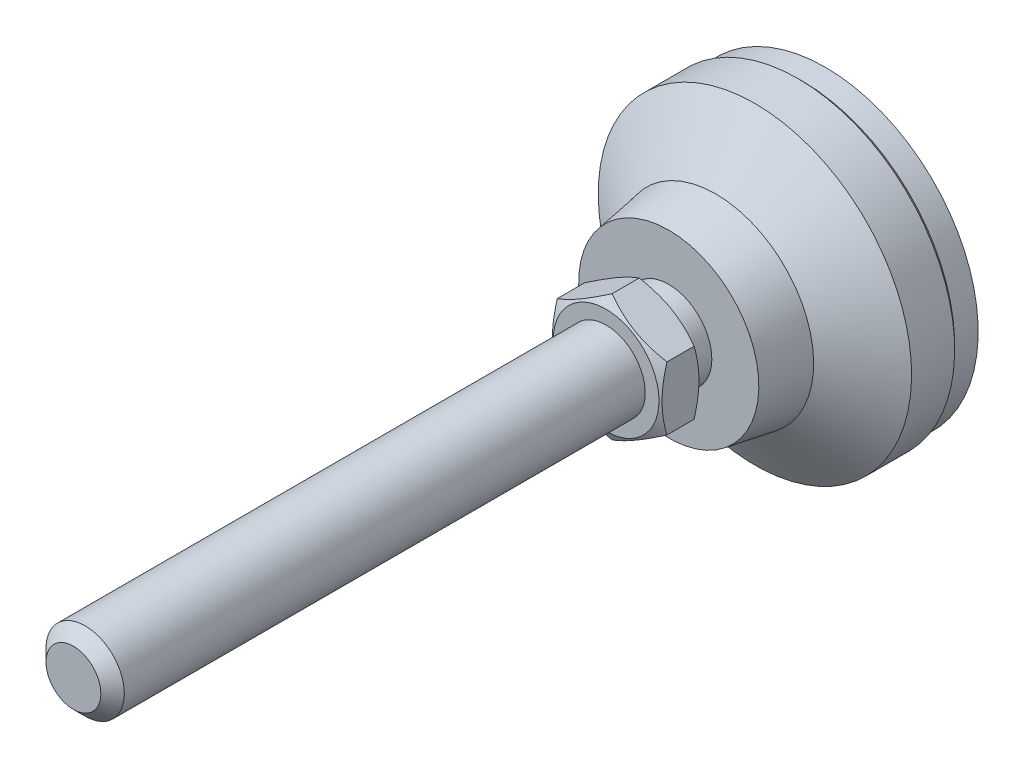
ISO-10303-21;
HEADER;
FILE_DESCRIPTION(('STEP AP214'),'2;1');
FILE_NAME('part.step','',(''),(''),'','','');
FILE_SCHEMA(('AUTOMOTIVE_DESIGN { 1 0 10303 214 1 1 1 1 }'));
ENDSEC;
DATA;
#1=APPLICATION_CONTEXT('core data for automotive mechanical design processes');
#2=APPLICATION_PROTOCOL_DEFINITION('international standard','automotive_design',2000,#1);
#3=PRODUCT_CONTEXT('',#1,'mechanical');
#4=PRODUCT('Part','Part','',(#3));
#5=PRODUCT_RELATED_PRODUCT_CATEGORY('part','',(#4));
#6=PRODUCT_DEFINITION_FORMATION('','',#4);
#7=PRODUCT_DEFINITION_CONTEXT('part definition',#1,'design');
#8=PRODUCT_DEFINITION('design','',#6,#7);
#9=PRODUCT_DEFINITION_SHAPE('','',#8);
#10=(LENGTH_UNIT() NAMED_UNIT(*) SI_UNIT(.MILLI.,.METRE.));
#11=(NAMED_UNIT(*) PLANE_ANGLE_UNIT() SI_UNIT($,.RADIAN.));
#12=(NAMED_UNIT(*) SI_UNIT($,.STERADIAN.) SOLID_ANGLE_UNIT());
#13=UNCERTAINTY_MEASURE_WITH_UNIT(LENGTH_MEASURE(1.E-05),#10,'distance_accuracy_value','');
#14=(GEOMETRIC_REPRESENTATION_CONTEXT(3) GLOBAL_UNCERTAINTY_ASSIGNED_CONTEXT((#13)) GLOBAL_UNIT_ASSIGNED_CONTEXT((#10,
#11,#12)) REPRESENTATION_CONTEXT('',''));
#15=CARTESIAN_POINT('',(0.,0.,0.));
#16=DIRECTION('',(0.,0.,1.));
#17=DIRECTION('',(1.,0.,0.));
#18=AXIS2_PLACEMENT_3D('',#15,#16,#17);
#19=CARTESIAN_POINT('',(0.,0.,1.99999999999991));
#20=DIRECTION('',(0.,0.,-1.));
#21=DIRECTION('',(0.,1.,0.));
#22=AXIS2_PLACEMENT_3D('',#19,#20,#21);
#23=CYLINDRICAL_SURFACE('',#22,20.);
#24=CARTESIAN_POINT('',(0.,0.,3.5));
#25=DIRECTION('',(0.,0.,-1.));
#26=DIRECTION('',(0.,1.,0.));
#27=AXIS2_PLACEMENT_3D('',#24,#25,#26);
#28=CIRCLE('',#27,20.);
#29=CARTESIAN_POINT('',(0.,20.,3.5));
#30=VERTEX_POINT('',#29);
#31=EDGE_CURVE('E114',#30,#30,#28,.F.);
#32=ORIENTED_EDGE('',*,*,#31,.T.);
#33=EDGE_LOOP('',(#32));
#34=FACE_BOUND('',#33,.T.);
#35=CARTESIAN_POINT('',(0.,0.,9.));
#36=DIRECTION('',(0.,0.,-1.));
#37=DIRECTION('',(0.,1.,0.));
#38=AXIS2_PLACEMENT_3D('',#35,#36,#37);
#39=CIRCLE('',#38,20.);
#40=CARTESIAN_POINT('',(0.,20.,9.));
#41=VERTEX_POINT('',#40);
#42=EDGE_CURVE('E108',#41,#41,#39,.T.);
#43=ORIENTED_EDGE('',*,*,#42,.T.);
#44=EDGE_LOOP('',(#43));
#45=FACE_BOUND('',#44,.T.);
#46=ADVANCED_FACE('F14',(#34,#45),#23,.T.);
#47=CARTESIAN_POINT('',(0.,0.,14.));
#48=DIRECTION('',(0.,0.,-1.));
#49=DIRECTION('',(0.,1.,0.));
#50=AXIS2_PLACEMENT_3D('',#47,#48,#49);
#51=CONICAL_SURFACE('',#50,12.5,0.98279372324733);
#52=ORIENTED_EDGE('',*,*,#42,.F.);
#53=EDGE_LOOP('',(#52));
#54=FACE_BOUND('',#53,.T.);
#55=CARTESIAN_POINT('',(0.,0.,14.));
#56=DIRECTION('',(0.,0.,-1.));
#57=DIRECTION('',(0.,1.,0.));
#58=AXIS2_PLACEMENT_3D('',#55,#56,#57);
#59=CIRCLE('',#58,12.5);
#60=CARTESIAN_POINT('',(0.,12.5,14.));
#61=VERTEX_POINT('',#60);
#62=EDGE_CURVE('E105',#61,#61,#59,.T.);
#63=ORIENTED_EDGE('',*,*,#62,.T.);
#64=EDGE_LOOP('',(#63));
#65=FACE_BOUND('',#64,.T.);
#66=ADVANCED_FACE('F226',(#54,#65),#51,.T.);
#67=CARTESIAN_POINT('',(0.,0.,20.));
#68=DIRECTION('',(0.,0.,-1.));
#69=DIRECTION('',(0.,1.,0.));
#70=AXIS2_PLACEMENT_3D('',#67,#68,#69);
#71=CONICAL_SURFACE('',#70,11.5,0.165148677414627);
#72=ORIENTED_EDGE('',*,*,#62,.F.);
#73=EDGE_LOOP('',(#72));
#74=FACE_BOUND('',#73,.T.);
#75=CARTESIAN_POINT('',(0.,0.,20.));
#76=DIRECTION('',(0.,0.,-1.));
#77=DIRECTION('',(0.,1.,0.));
#78=AXIS2_PLACEMENT_3D('',#75,#76,#77);
#79=CIRCLE('',#78,11.5);
#80=CARTESIAN_POINT('',(0.,11.5,20.));
#81=VERTEX_POINT('',#80);
#82=EDGE_CURVE('E102',#81,#81,#79,.T.);
#83=ORIENTED_EDGE('',*,*,#82,.T.);
#84=EDGE_LOOP('',(#83));
#85=FACE_BOUND('',#84,.T.);
#86=ADVANCED_FACE('F222',(#74,#85),#71,.T.);
#87=CARTESIAN_POINT('',(-11.5,0.,20.));
#88=DIRECTION('',(0.,0.,-1.));
#89=DIRECTION('',(0.,1.,0.));
#90=AXIS2_PLACEMENT_3D('',#87,#88,#89);
#91=PLANE('',#90);
#92=ORIENTED_EDGE('',*,*,#82,.F.);
#93=EDGE_LOOP('',(#92));
#94=FACE_BOUND('',#93,.T.);
#95=CARTESIAN_POINT('',(0.,0.,20.));
#96=DIRECTION('',(0.,0.,-1.));
#97=DIRECTION('',(0.,1.,0.));
#98=AXIS2_PLACEMENT_3D('',#95,#96,#97);
#99=CIRCLE('',#98,5.49999999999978);
#100=CARTESIAN_POINT('',(0.,5.49999999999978,20.));
#101=VERTEX_POINT('',#100);
#102=EDGE_CURVE('E99',#101,#101,#99,.T.);
#103=ORIENTED_EDGE('',*,*,#102,.T.);
#104=EDGE_LOOP('',(#103));
#105=FACE_BOUND('',#104,.T.);
#106=ADVANCED_FACE('F218',(#94,#105),#91,.F.);
#107=CARTESIAN_POINT('',(0.,0.,1.99999999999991));
#108=DIRECTION('',(0.,0.,-1.));
#109=DIRECTION('',(0.,1.,0.));
#110=AXIS2_PLACEMENT_3D('',#107,#108,#109);
#111=CYLINDRICAL_SURFACE('',#110,5.49999999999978);
#112=ORIENTED_EDGE('',*,*,#102,.F.);
#113=EDGE_LOOP('',(#112));
#114=FACE_BOUND('',#113,.T.);
#115=CARTESIAN_POINT('',(0.,0.,23.));
#116=DIRECTION('',(0.,0.,-1.));
#117=DIRECTION('',(0.,1.,0.));
#118=AXIS2_PLACEMENT_3D('',#115,#116,#117);
#119=CIRCLE('',#118,5.49999999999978);
#120=CARTESIAN_POINT('',(0.,5.49999999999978,23.));
#121=VERTEX_POINT('',#120);
#122=EDGE_CURVE('E96',#121,#121,#119,.T.);
#123=ORIENTED_EDGE('',*,*,#122,.T.);
#124=EDGE_LOOP('',(#123));
#125=FACE_BOUND('',#124,.T.);
#126=ADVANCED_FACE('F214',(#114,#125),#111,.T.);
#127=CARTESIAN_POINT('',(-5.49999999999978,0.,23.));
#128=DIRECTION('',(0.,0.,1.));
#129=DIRECTION('',(0.,-1.,0.));
#130=AXIS2_PLACEMENT_3D('',#127,#128,#129);
#131=PLANE('',#130);
#132=CARTESIAN_POINT('',(0.,0.,23.));
#133=DIRECTION('',(0.,0.,1.));
#134=DIRECTION('',(0.,-1.,0.));
#135=AXIS2_PLACEMENT_3D('',#132,#133,#134);
#136=CIRCLE('',#135,6.75);
#137=CARTESIAN_POINT('',(0.,-6.75,23.));
#138=VERTEX_POINT('',#137);
#139=EDGE_CURVE('E305',#138,#138,#136,.T.);
#140=ORIENTED_EDGE('',*,*,#139,.F.);
#141=EDGE_LOOP('',(#140));
#142=FACE_BOUND('',#141,.T.);
#143=ORIENTED_EDGE('',*,*,#122,.F.);
#144=EDGE_LOOP('',(#143));
#145=FACE_BOUND('',#144,.T.);
#146=ADVANCED_FACE('F211',(#142,#145),#131,.F.);
#147=CARTESIAN_POINT('',(0.,0.,3.));
#148=DIRECTION('',(0.,0.,1.));
#149=DIRECTION('',(0.,-1.,0.));
#150=AXIS2_PLACEMENT_3D('',#147,#148,#149);
#151=CONICAL_SURFACE('',#150,19.5,0.785398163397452);
#152=ORIENTED_EDGE('',*,*,#31,.F.);
#153=EDGE_LOOP('',(#152));
#154=FACE_BOUND('',#153,.T.);
#155=CARTESIAN_POINT('',(0.,0.,3.));
#156=DIRECTION('',(0.,0.,-1.));
#157=DIRECTION('',(0.,1.,0.));
#158=AXIS2_PLACEMENT_3D('',#155,#156,#157);
#159=CIRCLE('',#158,19.5);
#160=CARTESIAN_POINT('',(0.,19.5,3.));
#161=VERTEX_POINT('',#160);
#162=EDGE_CURVE('E111',#161,#161,#159,.T.);
#163=ORIENTED_EDGE('',*,*,#162,.F.);
#164=EDGE_LOOP('',(#163));
#165=FACE_BOUND('',#164,.T.);
#166=ADVANCED_FACE('F16',(#154,#165),#151,.T.);
#167=CARTESIAN_POINT('',(0.,0.,0.));
#168=DIRECTION('',(0.,0.,1.));
#169=DIRECTION('',(0.,-1.,0.));
#170=AXIS2_PLACEMENT_3D('',#167,#168,#169);
#171=CYLINDRICAL_SURFACE('',#170,19.5);
#172=CARTESIAN_POINT('',(0.,0.,0.));
#173=DIRECTION('',(0.,0.,-1.));
#174=DIRECTION('',(0.,1.,0.));
#175=AXIS2_PLACEMENT_3D('',#172,#173,#174);
#176=CIRCLE('',#175,19.5);
#177=CARTESIAN_POINT('',(0.,19.5,0.));
#178=VERTEX_POINT('',#177);
#179=EDGE_CURVE('E278',#178,#178,#176,.T.);
#180=ORIENTED_EDGE('',*,*,#179,.F.);
#181=EDGE_LOOP('',(#180));
#182=FACE_BOUND('',#181,.T.);
#183=ORIENTED_EDGE('',*,*,#162,.T.);
#184=EDGE_LOOP('',(#183));
#185=FACE_BOUND('',#184,.T.);
#186=ADVANCED_FACE('F251',(#182,#185),#171,.T.);
#187=CARTESIAN_POINT('',(0.,0.,0.));
#188=DIRECTION('',(0.,0.,-1.));
#189=DIRECTION('',(0.,1.,0.));
#190=AXIS2_PLACEMENT_3D('',#187,#188,#189);
#191=PLANE('',#190);
#192=ORIENTED_EDGE('',*,*,#179,.T.);
#193=EDGE_LOOP('',(#192));
#194=FACE_BOUND('',#193,.T.);
#195=ADVANCED_FACE('F134',(#194),#191,.T.);
#196=CARTESIAN_POINT('',(0.,0.,23.));
#197=DIRECTION('',(0.,0.,1.));
#198=DIRECTION('',(0.,-1.,0.));
#199=AXIS2_PLACEMENT_3D('',#196,#197,#198);
#200=CONICAL_SURFACE('',#199,6.75,1.0471975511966);
#201=CARTESIAN_POINT('',(0.000200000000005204,-8.08301923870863,23.7696190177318));
#202=CARTESIAN_POINT('',(-0.153667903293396,-7.99418356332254,23.7183374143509));
#203=CARTESIAN_POINT('',(-0.308109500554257,-7.90501666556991,23.669383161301));
#204=CARTESIAN_POINT('',(-0.618246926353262,-7.72595873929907,23.5767703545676));
#205=CARTESIAN_POINT('',(-0.773943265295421,-7.63606741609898,23.5331140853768));
#206=CARTESIAN_POINT('',(-1.24352516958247,-7.36495417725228,23.4109491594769));
#207=CARTESIAN_POINT('',(-1.55926433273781,-7.18266208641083,23.3414631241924));
#208=CARTESIAN_POINT('',(-2.03176224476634,-6.90986528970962,23.2599825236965));
#209=CARTESIAN_POINT('',(-2.1871092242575,-6.82017566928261,23.2367710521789));
#210=CARTESIAN_POINT('',(-2.49850511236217,-6.64039116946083,23.1978487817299));
#211=CARTESIAN_POINT('',(-2.65455395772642,-6.55029632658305,23.1821373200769));
#212=CARTESIAN_POINT('',(-2.96692267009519,-6.36995016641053,23.1586154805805));
#213=CARTESIAN_POINT('',(-3.12324202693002,-6.27969914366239,23.1507961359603));
#214=CARTESIAN_POINT('',(-3.43601650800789,-6.09911871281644,23.1432178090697));
#215=CARTESIAN_POINT('',(-3.59247162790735,-6.00878930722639,23.1434585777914));
#216=CARTESIAN_POINT('',(-4.02110687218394,-5.76131663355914,23.1551972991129));
#217=CARTESIAN_POINT('',(-4.2931466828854,-5.60425437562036,23.1749033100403));
#218=CARTESIAN_POINT('',(-4.83541944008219,-5.29117305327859,23.2373910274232));
#219=CARTESIAN_POINT('',(-5.10565047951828,-5.13515508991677,23.2801940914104));
#220=CARTESIAN_POINT('',(-5.64901454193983,-4.82144370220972,23.3871892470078));
#221=CARTESIAN_POINT('',(-5.92207900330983,-4.66378986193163,23.4518346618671));
#222=CARTESIAN_POINT('',(-6.46413578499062,-4.35083323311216,23.5985536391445));
#223=CARTESIAN_POINT('',(-6.73313504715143,-4.19552643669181,23.680592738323));
#224=CARTESIAN_POINT('',(-7.0002,-4.04133641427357,23.7696190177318));
#225=B_SPLINE_CURVE_WITH_KNOTS('',3,(#201,#202,#203,#204,#205,#206,#207,#208,#209,#210,#211,
#212,#213,#214,#215,#216,#217,#218,#219,#220,#221,#222,#223,#224),.UNSPECIFIED.,.F.,.F.,(4,2,2,
2,2,2,2,2,2,2,2,4),(0.,0.554727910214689,1.10969417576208,2.2219327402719,2.76443041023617,
3.30688013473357,3.8487128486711,4.39052882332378,5.33376515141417,6.27787517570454,
7.24292418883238,8.20607866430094),.UNSPECIFIED.);
#226=CARTESIAN_POINT('',(0.,-8.08290376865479,23.7695523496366));
#227=VERTEX_POINT('',#226);
#228=CARTESIAN_POINT('',(-7.,-4.04145188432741,23.7695523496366));
#229=VERTEX_POINT('',#228);
#230=EDGE_CURVE('E73',#227,#229,#225,.T.);
#231=ORIENTED_EDGE('',*,*,#230,.T.);
#232=CARTESIAN_POINT('',(-7.,10.8745412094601,26.5696039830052));
#233=CARTESIAN_POINT('',(-7.,10.5686471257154,26.421142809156));
#234=CARTESIAN_POINT('',(-7.,10.2620528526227,26.2740997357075));
#235=CARTESIAN_POINT('',(-7.,9.64709162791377,25.9836469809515));
#236=CARTESIAN_POINT('',(-7.,9.33872440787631,25.8402378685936));
#237=CARTESIAN_POINT('',(-7.,8.71826517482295,25.5571327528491));
#238=CARTESIAN_POINT('',(-7.,8.40616203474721,25.4174610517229));
#239=CARTESIAN_POINT('',(-7.,7.7794799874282,25.1438085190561));
#240=CARTESIAN_POINT('',(-7.,7.46490119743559,25.0098274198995));
#241=CARTESIAN_POINT('',(-7.,6.82254251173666,24.7448399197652));
#242=CARTESIAN_POINT('',(-7.,6.49466463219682,24.6140697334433));
#243=CARTESIAN_POINT('',(-7.,5.8350806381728,24.3623812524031));
#244=CARTESIAN_POINT('',(-7.,5.50337409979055,24.2414640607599));
#245=CARTESIAN_POINT('',(-7.,4.83621585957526,24.0126424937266));
#246=CARTESIAN_POINT('',(-7.,4.50077323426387,23.9047119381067));
#247=CARTESIAN_POINT('',(-7.,3.82508817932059,23.7053132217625));
#248=CARTESIAN_POINT('',(-7.,3.48484729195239,23.6138398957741));
#249=CARTESIAN_POINT('',(-7.,2.80120788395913,23.4522264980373));
#250=CARTESIAN_POINT('',(-7.,2.457837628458,23.3819700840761));
#251=CARTESIAN_POINT('',(-7.,1.93964005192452,23.2955301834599));
#252=CARTESIAN_POINT('',(-7.,1.76637105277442,23.2698731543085));
#253=CARTESIAN_POINT('',(-7.,1.41896625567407,23.2253769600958));
#254=CARTESIAN_POINT('',(-7.,1.24483054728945,23.2065371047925));
#255=CARTESIAN_POINT('',(-7.,0.898207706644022,23.1762876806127));
#256=CARTESIAN_POINT('',(-7.,0.725728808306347,23.1647841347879));
#257=CARTESIAN_POINT('',(-7.,0.380439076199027,23.1490821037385));
#258=CARTESIAN_POINT('',(-7.,0.207628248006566,23.1448834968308));
#259=CARTESIAN_POINT('',(-7.,-0.138016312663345,23.1438915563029));
#260=CARTESIAN_POINT('',(-7.,-0.310850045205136,23.147098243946));
#261=CARTESIAN_POINT('',(-7.,-0.656228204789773,23.1608382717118));
#262=CARTESIAN_POINT('',(-7.,-0.828772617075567,23.1713719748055));
#263=CARTESIAN_POINT('',(-7.,-1.24287822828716,23.2052220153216));
#264=CARTESIAN_POINT('',(-7.,-1.48416383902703,23.2319830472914));
#265=CARTESIAN_POINT('',(-7.,-1.96494522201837,23.2983774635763));
#266=CARTESIAN_POINT('',(-7.,-2.20444074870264,23.3380125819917));
#267=CARTESIAN_POINT('',(-7.,-2.9199676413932,23.4741275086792));
#268=CARTESIAN_POINT('',(-7.,-3.39277321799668,23.5877922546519));
#269=CARTESIAN_POINT('',(-7.,-4.09977365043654,23.7849167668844));
#270=CARTESIAN_POINT('',(-7.,-4.33763499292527,23.8559829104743));
#271=CARTESIAN_POINT('',(-7.,-4.81104746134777,24.0055016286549));
#272=CARTESIAN_POINT('',(-7.,-5.04659857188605,24.0839542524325));
#273=CARTESIAN_POINT('',(-7.,-5.51546461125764,24.2469867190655));
#274=CARTESIAN_POINT('',(-7.,-5.748780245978,24.3315645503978));
#275=CARTESIAN_POINT('',(-7.,-6.21347798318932,24.505851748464));
#276=CARTESIAN_POINT('',(-7.,-6.44486010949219,24.5955610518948));
#277=CARTESIAN_POINT('',(-7.,-6.99554170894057,24.8149734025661));
#278=CARTESIAN_POINT('',(-7.,-7.31404731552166,24.9466653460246));
#279=CARTESIAN_POINT('',(-7.,-7.94831169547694,25.2165249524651));
#280=CARTESIAN_POINT('',(-7.,-8.26407029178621,25.3546930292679));
#281=CARTESIAN_POINT('',(-7.,-8.89335302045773,25.6361891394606));
#282=CARTESIAN_POINT('',(-7.,-9.20687666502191,25.7795182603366));
#283=CARTESIAN_POINT('',(-7.,-9.83201350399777,26.0702913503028));
#284=CARTESIAN_POINT('',(-7.,-10.14362665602,26.2177354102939));
#285=CARTESIAN_POINT('',(-7.,-10.7655959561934,26.5161189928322));
#286=CARTESIAN_POINT('',(-7.,-11.0759503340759,26.6670621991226));
#287=CARTESIAN_POINT('',(-7.,-11.695313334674,26.9716873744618));
#288=CARTESIAN_POINT('',(-7.,-12.0043219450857,27.1253693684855));
#289=CARTESIAN_POINT('',(-7.,-12.9295683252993,27.589744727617));
#290=CARTESIAN_POINT('',(-7.,-13.5441137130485,27.903809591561));
#291=CARTESIAN_POINT('',(-7.,-14.7176326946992,28.5111691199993));
#292=CARTESIAN_POINT('',(-7.,-15.2768737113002,28.8039494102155));
#293=CARTESIAN_POINT('',(-7.,-16.3932852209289,29.3934782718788));
#294=CARTESIAN_POINT('',(-7.,-16.9504556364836,29.6902269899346));
#295=CARTESIAN_POINT('',(-7.,-18.0617579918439,30.2859761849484));
#296=CARTESIAN_POINT('',(-7.,-18.6158940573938,30.584968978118));
#297=CARTESIAN_POINT('',(-7.,-19.7228452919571,31.1853162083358));
#298=CARTESIAN_POINT('',(-7.,-20.2756605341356,31.486670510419));
#299=CARTESIAN_POINT('',(-7.,-20.8279911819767,31.7889044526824));
#300=B_SPLINE_CURVE_WITH_KNOTS('',3,(#232,#233,#234,#235,#236,#237,#238,#239,#240,#241,#242,
#243,#244,#245,#246,#247,#248,#249,#250,#251,#252,#253,#254,#255,#256,#257,#258,#259,#260,#261,
#262,#263,#264,#265,#266,#267,#268,#269,#270,#271,#272,#273,#274,#275,#276,#277,#278,#279,#280,
#281,#282,#283,#284,#285,#286,#287,#288,#289,#290,#291,#292,#293,#294,#295,#296,#297,#298,#299),
.UNSPECIFIED.,.F.,.F.,(4,2,2,2,2,2,2,2,2,2,2,2,2,2,2,2,2,2,2,2,2,2,2,2,2,2,2,2,2,2,2,2,2,4),(0.,
1.02006490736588,2.04028854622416,3.06603489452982,4.09173295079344,5.15059197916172,
6.20956938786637,7.26637486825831,8.322848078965,9.37341832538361,9.89878022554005,
10.4240889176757,10.9425256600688,11.4609537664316,11.9793833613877,12.4978386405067,
13.225723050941,13.9537055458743,15.4104686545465,16.1551584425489,16.8998531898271,
17.6443044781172,18.3887465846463,19.4226209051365,20.4565613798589,21.4907210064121,
22.5249034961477,23.5602291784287,24.5955643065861,26.6659444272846,28.5596638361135,
30.4534534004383,32.3424076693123,34.2312547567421),.UNSPECIFIED.);
#301=CARTESIAN_POINT('',(-7.,4.04145188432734,23.7695523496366));
#302=VERTEX_POINT('',#301);
#303=EDGE_CURVE('E81',#229,#302,#300,.F.);
#304=ORIENTED_EDGE('',*,*,#303,.T.);
#305=CARTESIAN_POINT('',(-7.0002,4.0413364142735,23.7696190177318));
#306=CARTESIAN_POINT('',(-6.8463320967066,4.13017208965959,23.7183374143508));
#307=CARTESIAN_POINT('',(-6.69189049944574,4.21933898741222,23.669383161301));
#308=CARTESIAN_POINT('',(-6.38175307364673,4.39839691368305,23.5767703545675));
#309=CARTESIAN_POINT('',(-6.22605673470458,4.48828823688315,23.5331140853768));
#310=CARTESIAN_POINT('',(-5.75647483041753,4.75940147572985,23.4109491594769));
#311=CARTESIAN_POINT('',(-5.4407356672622,4.94169356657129,23.3414631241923));
#312=CARTESIAN_POINT('',(-4.96823775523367,5.2144903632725,23.2599825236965));
#313=CARTESIAN_POINT('',(-4.81289077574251,5.30417998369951,23.2367710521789));
#314=CARTESIAN_POINT('',(-4.50149488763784,5.48396448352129,23.1978487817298));
#315=CARTESIAN_POINT('',(-4.34544604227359,5.57405932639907,23.1821373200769));
#316=CARTESIAN_POINT('',(-4.03307732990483,5.75440548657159,23.1586154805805));
#317=CARTESIAN_POINT('',(-3.87675797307,5.84465650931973,23.1507961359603));
#318=CARTESIAN_POINT('',(-3.56398349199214,6.02523694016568,23.1432178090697));
#319=CARTESIAN_POINT('',(-3.40752837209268,6.11556634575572,23.1434585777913));
#320=CARTESIAN_POINT('',(-2.97889312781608,6.36303901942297,23.1551972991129));
#321=CARTESIAN_POINT('',(-2.70685331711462,6.52010127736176,23.1749033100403));
#322=CARTESIAN_POINT('',(-2.16458055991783,6.83318259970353,23.2373910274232));
#323=CARTESIAN_POINT('',(-1.89434952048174,6.98920056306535,23.2801940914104));
#324=CARTESIAN_POINT('',(-1.35098545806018,7.3029119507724,23.3871892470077));
#325=CARTESIAN_POINT('',(-1.07792099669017,7.4605657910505,23.4518346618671));
#326=CARTESIAN_POINT('',(-0.535864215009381,7.77352241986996,23.5985536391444));
#327=CARTESIAN_POINT('',(-0.266864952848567,7.92882921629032,23.6805927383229));
#328=CARTESIAN_POINT('',(0.000200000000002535,8.08301923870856,23.7696190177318));
#329=B_SPLINE_CURVE_WITH_KNOTS('',3,(#305,#306,#307,#308,#309,#310,#311,#312,#313,#314,#315,
#316,#317,#318,#319,#320,#321,#322,#323,#324,#325,#326,#327,#328),.UNSPECIFIED.,.F.,.F.,(4,2,2,
2,2,2,2,2,2,2,2,4),(0.,0.554727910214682,1.10969417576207,2.22193274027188,2.76443041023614,
3.30688013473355,3.84871284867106,4.39052882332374,5.33376515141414,6.27787517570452,
7.24292418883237,8.20607866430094),.UNSPECIFIED.);
#330=CARTESIAN_POINT('',(0.,8.08290376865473,23.7695523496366));
#331=VERTEX_POINT('',#330);
#332=EDGE_CURVE('E193',#302,#331,#329,.T.);
#333=ORIENTED_EDGE('',*,*,#332,.T.);
#334=CARTESIAN_POINT('',(-0.000199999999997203,8.08301923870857,23.7696190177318));
#335=CARTESIAN_POINT('',(0.153667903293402,7.99418356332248,23.7183374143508));
#336=CARTESIAN_POINT('',(0.308109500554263,7.90501666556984,23.669383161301));
#337=CARTESIAN_POINT('',(0.618246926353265,7.72595873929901,23.5767703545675));
#338=CARTESIAN_POINT('',(0.773943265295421,7.63606741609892,23.5331140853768));
#339=CARTESIAN_POINT('',(1.24352516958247,7.36495417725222,23.4109491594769));
#340=CARTESIAN_POINT('',(1.5592643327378,7.18266208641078,23.3414631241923));
#341=CARTESIAN_POINT('',(2.03176224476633,6.90986528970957,23.2599825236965));
#342=CARTESIAN_POINT('',(2.18710922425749,6.82017566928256,23.2367710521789));
#343=CARTESIAN_POINT('',(2.49850511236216,6.64039116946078,23.1978487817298));
#344=CARTESIAN_POINT('',(2.65455395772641,6.550296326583,23.1821373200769));
#345=CARTESIAN_POINT('',(2.96692267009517,6.36995016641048,23.1586154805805));
#346=CARTESIAN_POINT('',(3.12324202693,6.27969914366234,23.1507961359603));
#347=CARTESIAN_POINT('',(3.43601650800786,6.09911871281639,23.1432178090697));
#348=CARTESIAN_POINT('',(3.59247162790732,6.00878930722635,23.1434585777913));
#349=CARTESIAN_POINT('',(4.02110687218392,5.7613166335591,23.1551972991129));
#350=CARTESIAN_POINT('',(4.29314668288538,5.60425437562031,23.1749033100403));
#351=CARTESIAN_POINT('',(4.83541944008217,5.29117305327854,23.2373910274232));
#352=CARTESIAN_POINT('',(5.10565047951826,5.13515508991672,23.2801940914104));
#353=CARTESIAN_POINT('',(5.64901454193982,4.82144370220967,23.3871892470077));
#354=CARTESIAN_POINT('',(5.92207900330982,4.66378986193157,23.4518346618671));
#355=CARTESIAN_POINT('',(6.46413578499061,4.35083323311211,23.5985536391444));
#356=CARTESIAN_POINT('',(6.73313504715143,4.19552643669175,23.6805927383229));
#357=CARTESIAN_POINT('',(7.0002,4.04133641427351,23.7696190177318));
#358=B_SPLINE_CURVE_WITH_KNOTS('',3,(#334,#335,#336,#337,#338,#339,#340,#341,#342,#343,#344,
#345,#346,#347,#348,#349,#350,#351,#352,#353,#354,#355,#356,#357),.UNSPECIFIED.,.F.,.F.,(4,2,2,
2,2,2,2,2,2,2,2,4),(0.,0.554727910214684,1.10969417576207,2.22193274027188,2.76443041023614,
3.30688013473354,3.84871284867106,4.39052882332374,5.33376515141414,6.27787517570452,
7.24292418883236,8.20607866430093),.UNSPECIFIED.);
#359=CARTESIAN_POINT('',(7.,4.04145188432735,23.7695523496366));
#360=VERTEX_POINT('',#359);
#361=EDGE_CURVE('E304',#331,#360,#358,.T.);
#362=ORIENTED_EDGE('',*,*,#361,.T.);
#363=CARTESIAN_POINT('',(7.,10.8745412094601,26.5696039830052));
#364=CARTESIAN_POINT('',(7.,10.5686471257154,26.421142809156));
#365=CARTESIAN_POINT('',(7.,10.2620528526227,26.2740997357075));
#366=CARTESIAN_POINT('',(7.,9.64709162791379,25.9836469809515));
#367=CARTESIAN_POINT('',(7.,9.33872440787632,25.8402378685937));
#368=CARTESIAN_POINT('',(7.,8.71826517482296,25.5571327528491));
#369=CARTESIAN_POINT('',(7.,8.40616203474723,25.4174610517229));
#370=CARTESIAN_POINT('',(7.,7.77947998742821,25.1438085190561));
#371=CARTESIAN_POINT('',(7.,7.4649011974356,25.0098274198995));
#372=CARTESIAN_POINT('',(7.,6.82254251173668,24.7448399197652));
#373=CARTESIAN_POINT('',(7.,6.49466463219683,24.6140697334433));
#374=CARTESIAN_POINT('',(7.,5.83508063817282,24.3623812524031));
#375=CARTESIAN_POINT('',(7.,5.50337409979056,24.2414640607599));
#376=CARTESIAN_POINT('',(7.,4.83621585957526,24.0126424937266));
#377=CARTESIAN_POINT('',(7.,4.50077323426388,23.9047119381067));
#378=CARTESIAN_POINT('',(7.,3.82508817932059,23.7053132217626));
#379=CARTESIAN_POINT('',(7.,3.4848472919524,23.6138398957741));
#380=CARTESIAN_POINT('',(7.,2.80120788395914,23.4522264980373));
#381=CARTESIAN_POINT('',(7.,2.457837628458,23.3819700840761));
#382=CARTESIAN_POINT('',(7.,1.93964005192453,23.2955301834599));
#383=CARTESIAN_POINT('',(7.,1.76637105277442,23.2698731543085));
#384=CARTESIAN_POINT('',(7.,1.41896625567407,23.2253769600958));
#385=CARTESIAN_POINT('',(7.,1.24483054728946,23.2065371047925));
#386=CARTESIAN_POINT('',(7.,0.898207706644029,23.1762876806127));
#387=CARTESIAN_POINT('',(7.,0.725728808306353,23.1647841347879));
#388=CARTESIAN_POINT('',(7.,0.380439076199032,23.1490821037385));
#389=CARTESIAN_POINT('',(7.,0.207628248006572,23.1448834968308));
#390=CARTESIAN_POINT('',(7.,-0.138016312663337,23.1438915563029));
#391=CARTESIAN_POINT('',(7.,-0.310850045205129,23.147098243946));
#392=CARTESIAN_POINT('',(7.,-0.656228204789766,23.1608382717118));
#393=CARTESIAN_POINT('',(7.,-0.828772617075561,23.1713719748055));
#394=CARTESIAN_POINT('',(7.,-1.24287822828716,23.2052220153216));
#395=CARTESIAN_POINT('',(7.,-1.48416383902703,23.2319830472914));
#396=CARTESIAN_POINT('',(7.,-1.96494522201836,23.2983774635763));
#397=CARTESIAN_POINT('',(7.,-2.20444074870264,23.3380125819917));
#398=CARTESIAN_POINT('',(7.,-2.91996764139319,23.4741275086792));
#399=CARTESIAN_POINT('',(7.,-3.39277321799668,23.5877922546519));
#400=CARTESIAN_POINT('',(7.,-4.09977365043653,23.7849167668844));
#401=CARTESIAN_POINT('',(7.,-4.33763499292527,23.8559829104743));
#402=CARTESIAN_POINT('',(7.,-4.81104746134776,24.0055016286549));
#403=CARTESIAN_POINT('',(7.,-5.04659857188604,24.0839542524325));
#404=CARTESIAN_POINT('',(7.,-5.51546461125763,24.2469867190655));
#405=CARTESIAN_POINT('',(7.,-5.748780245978,24.3315645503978));
#406=CARTESIAN_POINT('',(7.,-6.21347798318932,24.505851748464));
#407=CARTESIAN_POINT('',(7.,-6.44486010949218,24.5955610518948));
#408=CARTESIAN_POINT('',(7.,-6.99554170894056,24.8149734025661));
#409=CARTESIAN_POINT('',(7.,-7.31404731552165,24.9466653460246));
#410=CARTESIAN_POINT('',(7.,-7.94831169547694,25.2165249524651));
#411=CARTESIAN_POINT('',(7.,-8.26407029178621,25.3546930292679));
#412=CARTESIAN_POINT('',(7.,-8.89335302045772,25.6361891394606));
#413=CARTESIAN_POINT('',(7.,-9.2068766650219,25.7795182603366));
#414=CARTESIAN_POINT('',(7.,-9.83201350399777,26.0702913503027));
#415=CARTESIAN_POINT('',(7.,-10.14362665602,26.2177354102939));
#416=CARTESIAN_POINT('',(7.,-10.7655959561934,26.5161189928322));
#417=CARTESIAN_POINT('',(7.,-11.0759503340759,26.6670621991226));
#418=CARTESIAN_POINT('',(7.,-11.695313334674,26.9716873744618));
#419=CARTESIAN_POINT('',(7.,-12.0043219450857,27.1253693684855));
#420=CARTESIAN_POINT('',(7.,-12.9295683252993,27.589744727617));
#421=CARTESIAN_POINT('',(7.,-13.5441137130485,27.903809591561));
#422=CARTESIAN_POINT('',(7.,-14.7176326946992,28.5111691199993));
#423=CARTESIAN_POINT('',(7.,-15.2768737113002,28.8039494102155));
#424=CARTESIAN_POINT('',(7.,-16.3932852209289,29.3934782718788));
#425=CARTESIAN_POINT('',(7.,-16.9504556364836,29.6902269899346));
#426=CARTESIAN_POINT('',(7.,-18.0617579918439,30.2859761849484));
#427=CARTESIAN_POINT('',(7.,-18.6158940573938,30.584968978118));
#428=CARTESIAN_POINT('',(7.,-19.7228452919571,31.1853162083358));
#429=CARTESIAN_POINT('',(7.,-20.2756605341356,31.486670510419));
#430=CARTESIAN_POINT('',(7.,-20.8279911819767,31.7889044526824));
#431=B_SPLINE_CURVE_WITH_KNOTS('',3,(#363,#364,#365,#366,#367,#368,#369,#370,#371,#372,#373,
#374,#375,#376,#377,#378,#379,#380,#381,#382,#383,#384,#385,#386,#387,#388,#389,#390,#391,#392,
#393,#394,#395,#396,#397,#398,#399,#400,#401,#402,#403,#404,#405,#406,#407,#408,#409,#410,#411,
#412,#413,#414,#415,#416,#417,#418,#419,#420,#421,#422,#423,#424,#425,#426,#427,#428,#429,#430),
.UNSPECIFIED.,.F.,.F.,(4,2,2,2,2,2,2,2,2,2,2,2,2,2,2,2,2,2,2,2,2,2,2,2,2,2,2,2,2,2,2,2,2,4),(0.,
1.02006490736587,2.04028854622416,3.06603489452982,4.09173295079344,5.15059197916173,
6.20956938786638,7.26637486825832,8.32284807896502,9.37341832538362,9.89878022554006,
10.4240889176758,10.9425256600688,11.4609537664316,11.9793833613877,12.4978386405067,
13.225723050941,13.9537055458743,15.4104686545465,16.1551584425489,16.8998531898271,
17.6443044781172,18.3887465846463,19.4226209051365,20.4565613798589,21.4907210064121,
22.5249034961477,23.5602291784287,24.5955643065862,26.6659444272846,28.5596638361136,
30.4534534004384,32.3424076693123,34.2312547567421),.UNSPECIFIED.);
#432=CARTESIAN_POINT('',(7.,-4.04145188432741,23.7695523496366));
#433=VERTEX_POINT('',#432);
#434=EDGE_CURVE('E34',#360,#433,#431,.T.);
#435=ORIENTED_EDGE('',*,*,#434,.T.);
#436=CARTESIAN_POINT('',(7.0002,-4.04133641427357,23.7696190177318));
#437=CARTESIAN_POINT('',(6.8463320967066,-4.13017208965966,23.7183374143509));
#438=CARTESIAN_POINT('',(6.69189049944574,-4.2193389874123,23.669383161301));
#439=CARTESIAN_POINT('',(6.38175307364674,-4.39839691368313,23.5767703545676));
#440=CARTESIAN_POINT('',(6.22605673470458,-4.48828823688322,23.5331140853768));
#441=CARTESIAN_POINT('',(5.75647483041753,-4.75940147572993,23.4109491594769));
#442=CARTESIAN_POINT('',(5.44073566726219,-4.94169356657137,23.3414631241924));
#443=CARTESIAN_POINT('',(4.96823775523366,-5.21449036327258,23.2599825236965));
#444=CARTESIAN_POINT('',(4.8128907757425,-5.30417998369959,23.2367710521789));
#445=CARTESIAN_POINT('',(4.50149488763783,-5.48396448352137,23.1978487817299));
#446=CARTESIAN_POINT('',(4.34544604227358,-5.57405932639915,23.1821373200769));
#447=CARTESIAN_POINT('',(4.03307732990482,-5.75440548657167,23.1586154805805));
#448=CARTESIAN_POINT('',(3.87675797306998,-5.84465650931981,23.1507961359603));
#449=CARTESIAN_POINT('',(3.56398349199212,-6.02523694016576,23.1432178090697));
#450=CARTESIAN_POINT('',(3.40752837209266,-6.11556634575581,23.1434585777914));
#451=CARTESIAN_POINT('',(2.97889312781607,-6.36303901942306,23.1551972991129));
#452=CARTESIAN_POINT('',(2.70685331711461,-6.52010127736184,23.1749033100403));
#453=CARTESIAN_POINT('',(2.16458055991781,-6.83318259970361,23.2373910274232));
#454=CARTESIAN_POINT('',(1.89434952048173,-6.98920056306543,23.2801940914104));
#455=CARTESIAN_POINT('',(1.35098545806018,-7.30291195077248,23.3871892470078));
#456=CARTESIAN_POINT('',(1.07792099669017,-7.46056579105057,23.4518346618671));
#457=CARTESIAN_POINT('',(0.535864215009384,-7.77352241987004,23.5985536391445));
#458=CARTESIAN_POINT('',(0.266864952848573,-7.92882921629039,23.680592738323));
#459=CARTESIAN_POINT('',(-0.000199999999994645,-8.08301923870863,23.7696190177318));
#460=B_SPLINE_CURVE_WITH_KNOTS('',3,(#436,#437,#438,#439,#440,#441,#442,#443,#444,#445,#446,
#447,#448,#449,#450,#451,#452,#453,#454,#455,#456,#457,#458,#459),.UNSPECIFIED.,.F.,.F.,(4,2,2,
2,2,2,2,2,2,2,2,4),(0.,0.554727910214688,1.10969417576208,2.22193274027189,2.76443041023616,
3.30688013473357,3.84871284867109,4.39052882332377,5.33376515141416,6.27787517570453,
7.24292418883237,8.20607866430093),.UNSPECIFIED.);
#461=EDGE_CURVE('E9',#433,#227,#460,.T.);
#462=ORIENTED_EDGE('',*,*,#461,.T.);
#463=EDGE_LOOP('',(#231,#304,#333,#362,#435,#462));
#464=FACE_BOUND('',#463,.T.);
#465=ORIENTED_EDGE('',*,*,#139,.T.);
#466=EDGE_LOOP('',(#465));
#467=FACE_BOUND('',#466,.T.);
#468=ADVANCED_FACE('F71',(#464,#467),#200,.T.);
#469=CARTESIAN_POINT('',(0.,0.,96.));
#470=DIRECTION('',(0.,0.,-1.));
#471=DIRECTION('',(0.,1.,0.));
#472=AXIS2_PLACEMENT_3D('',#469,#470,#471);
#473=PLANE('',#472);
#474=CARTESIAN_POINT('',(0.,0.,96.));
#475=DIRECTION('',(0.,0.,-1.));
#476=DIRECTION('',(0.,1.,0.));
#477=AXIS2_PLACEMENT_3D('',#474,#475,#476);
#478=CIRCLE('',#477,3.5);
#479=CARTESIAN_POINT('',(0.,3.5,96.));
#480=VERTEX_POINT('',#479);
#481=EDGE_CURVE('E87',#480,#480,#478,.T.);
#482=ORIENTED_EDGE('',*,*,#481,.F.);
#483=EDGE_LOOP('',(#482));
#484=FACE_BOUND('',#483,.T.);
#485=ADVANCED_FACE('F183',(#484),#473,.F.);
#486=CARTESIAN_POINT('',(0.,0.,96.));
#487=DIRECTION('',(0.,0.,-1.));
#488=DIRECTION('',(0.,1.,0.));
#489=AXIS2_PLACEMENT_3D('',#486,#487,#488);
#490=CONICAL_SURFACE('',#489,3.5,0.785398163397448);
#491=CARTESIAN_POINT('',(0.,0.,94.5));
#492=DIRECTION('',(0.,0.,-1.));
#493=DIRECTION('',(0.,1.,0.));
#494=AXIS2_PLACEMENT_3D('',#491,#492,#493);
#495=CIRCLE('',#494,5.);
#496=CARTESIAN_POINT('',(0.,5.,94.5));
#497=VERTEX_POINT('',#496);
#498=EDGE_CURVE('E92',#497,#497,#495,.T.);
#499=ORIENTED_EDGE('',*,*,#498,.F.);
#500=EDGE_LOOP('',(#499));
#501=FACE_BOUND('',#500,.T.);
#502=ORIENTED_EDGE('',*,*,#481,.T.);
#503=EDGE_LOOP('',(#502));
#504=FACE_BOUND('',#503,.T.);
#505=ADVANCED_FACE('F264',(#501,#504),#490,.T.);
#506=CARTESIAN_POINT('',(0.,0.,-4.74975615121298));
#507=DIRECTION('',(0.,0.,-1.));
#508=DIRECTION('',(0.,1.,0.));
#509=AXIS2_PLACEMENT_3D('',#506,#507,#508);
#510=CYLINDRICAL_SURFACE('',#509,5.);
#511=CARTESIAN_POINT('',(0.,0.,28.));
#512=DIRECTION('',(0.,0.,-1.));
#513=DIRECTION('',(0.,1.,0.));
#514=AXIS2_PLACEMENT_3D('',#511,#512,#513);
#515=CIRCLE('',#514,5.);
#516=CARTESIAN_POINT('',(0.,5.,28.));
#517=VERTEX_POINT('',#516);
#518=EDGE_CURVE('E117',#517,#517,#515,.F.);
#519=ORIENTED_EDGE('',*,*,#518,.T.);
#520=EDGE_LOOP('',(#519));
#521=FACE_BOUND('',#520,.T.);
#522=ORIENTED_EDGE('',*,*,#498,.T.);
#523=EDGE_LOOP('',(#522));
#524=FACE_BOUND('',#523,.T.);
#525=ADVANCED_FACE('F209',(#521,#524),#510,.T.);
#526=CARTESIAN_POINT('',(-3.99999999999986,0.,28.));
#527=DIRECTION('',(0.,0.,-1.));
#528=DIRECTION('',(0.,1.,0.));
#529=AXIS2_PLACEMENT_3D('',#526,#527,#528);
#530=PLANE('',#529);
#531=CARTESIAN_POINT('',(0.,0.,28.));
#532=DIRECTION('',(0.,0.,1.));
#533=DIRECTION('',(0.,-1.,0.));
#534=AXIS2_PLACEMENT_3D('',#531,#532,#533);
#535=CIRCLE('',#534,6.75);
#536=CARTESIAN_POINT('',(0.,-6.75,28.));
#537=VERTEX_POINT('',#536);
#538=EDGE_CURVE('E80',#537,#537,#535,.T.);
#539=ORIENTED_EDGE('',*,*,#538,.T.);
#540=EDGE_LOOP('',(#539));
#541=FACE_BOUND('',#540,.T.);
#542=ORIENTED_EDGE('',*,*,#518,.F.);
#543=EDGE_LOOP('',(#542));
#544=FACE_BOUND('',#543,.T.);
#545=ADVANCED_FACE('F131',(#541,#544),#530,.F.);
#546=CARTESIAN_POINT('',(0.,0.,25.9669106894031));
#547=DIRECTION('',(0.,0.,-1.));
#548=DIRECTION('',(0.,1.,0.));
#549=AXIS2_PLACEMENT_3D('',#546,#547,#548);
#550=CONICAL_SURFACE('',#549,10.2714139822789,1.0471975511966);
#551=CARTESIAN_POINT('',(-7.0002,-4.04133641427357,27.230380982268));
#552=CARTESIAN_POINT('',(-6.84633209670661,-4.13017208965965,27.281662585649));
#553=CARTESIAN_POINT('',(-6.69189049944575,-4.21933898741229,27.3306168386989));
#554=CARTESIAN_POINT('',(-6.38175307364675,-4.39839691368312,27.4232296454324));
#555=CARTESIAN_POINT('',(-6.22605673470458,-4.48828823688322,27.4668859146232));
#556=CARTESIAN_POINT('',(-5.75647483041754,-4.75940147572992,27.589050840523));
#557=CARTESIAN_POINT('',(-5.4407356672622,-4.94169356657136,27.6585368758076));
#558=CARTESIAN_POINT('',(-4.96823775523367,-5.21449036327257,27.7400174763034));
#559=CARTESIAN_POINT('',(-4.81289077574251,-5.30417998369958,27.763228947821));
#560=CARTESIAN_POINT('',(-4.50149488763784,-5.48396448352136,27.80215121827));
#561=CARTESIAN_POINT('',(-4.34544604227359,-5.57405932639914,27.817862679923));
#562=CARTESIAN_POINT('',(-4.03307732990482,-5.75440548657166,27.8413845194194));
#563=CARTESIAN_POINT('',(-3.87675797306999,-5.8446565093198,27.8492038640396));
#564=CARTESIAN_POINT('',(-3.56398349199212,-6.02523694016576,27.8567821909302));
#565=CARTESIAN_POINT('',(-3.40752837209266,-6.11556634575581,27.8565414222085));
#566=CARTESIAN_POINT('',(-2.97889312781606,-6.36303901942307,27.8448027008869));
#567=CARTESIAN_POINT('',(-2.7068533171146,-6.52010127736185,27.8250966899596));
#568=CARTESIAN_POINT('',(-2.1645805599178,-6.83318259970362,27.7626089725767));
#569=CARTESIAN_POINT('',(-1.89434952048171,-6.98920056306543,27.7198059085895));
#570=CARTESIAN_POINT('',(-1.35098545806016,-7.30291195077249,27.6128107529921));
#571=CARTESIAN_POINT('',(-1.07792099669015,-7.46056579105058,27.5481653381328));
#572=CARTESIAN_POINT('',(-0.535864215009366,-7.77352241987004,27.4014463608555));
#573=CARTESIAN_POINT('',(-0.266864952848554,-7.9288292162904,27.3194072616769));
#574=CARTESIAN_POINT('',(0.000200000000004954,-8.08301923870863,27.230380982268));
#575=B_SPLINE_CURVE_WITH_KNOTS('',3,(#551,#552,#553,#554,#555,#556,#557,#558,#559,#560,#561,
#562,#563,#564,#565,#566,#567,#568,#569,#570,#571,#572,#573,#574),.UNSPECIFIED.,.F.,.F.,(4,2,2,
2,2,2,2,2,2,2,2,4),(0.,0.554727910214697,1.10969417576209,2.2219327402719,2.76443041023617,
3.30688013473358,3.8487128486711,4.3905288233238,5.33376515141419,6.27787517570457,
7.24292418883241,8.20607866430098),.UNSPECIFIED.);
#576=CARTESIAN_POINT('',(-7.,-4.04145188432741,27.2304476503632));
#577=VERTEX_POINT('',#576);
#578=CARTESIAN_POINT('',(0.,-8.08290376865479,27.2304476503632));
#579=VERTEX_POINT('',#578);
#580=EDGE_CURVE('E171',#577,#579,#575,.T.);
#581=ORIENTED_EDGE('',*,*,#580,.T.);
#582=CARTESIAN_POINT('',(-0.00019999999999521,-8.08301923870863,27.230380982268));
#583=CARTESIAN_POINT('',(0.153667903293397,-7.99418356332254,27.281662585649));
#584=CARTESIAN_POINT('',(0.308109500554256,-7.90501666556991,27.3306168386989));
#585=CARTESIAN_POINT('',(0.618246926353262,-7.72595873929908,27.4232296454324));
#586=CARTESIAN_POINT('',(0.773943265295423,-7.63606741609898,27.4668859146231));
#587=CARTESIAN_POINT('',(1.24352516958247,-7.36495417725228,27.589050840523));
#588=CARTESIAN_POINT('',(1.55926433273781,-7.18266208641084,27.6585368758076));
#589=CARTESIAN_POINT('',(2.03176224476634,-6.90986528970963,27.7400174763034));
#590=CARTESIAN_POINT('',(2.1871092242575,-6.82017566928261,27.763228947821));
#591=CARTESIAN_POINT('',(2.49850511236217,-6.64039116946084,27.80215121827));
#592=CARTESIAN_POINT('',(2.65455395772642,-6.55029632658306,27.817862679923));
#593=CARTESIAN_POINT('',(2.96692267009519,-6.36995016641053,27.8413845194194));
#594=CARTESIAN_POINT('',(3.12324202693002,-6.27969914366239,27.8492038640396));
#595=CARTESIAN_POINT('',(3.43601650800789,-6.09911871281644,27.8567821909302));
#596=CARTESIAN_POINT('',(3.59247162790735,-6.00878930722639,27.8565414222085));
#597=CARTESIAN_POINT('',(4.02110687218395,-5.76131663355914,27.8448027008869));
#598=CARTESIAN_POINT('',(4.29314668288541,-5.60425437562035,27.8250966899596));
#599=CARTESIAN_POINT('',(4.83541944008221,-5.29117305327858,27.7626089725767));
#600=CARTESIAN_POINT('',(5.10565047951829,-5.13515508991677,27.7198059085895));
#601=CARTESIAN_POINT('',(5.64901454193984,-4.82144370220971,27.6128107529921));
#602=CARTESIAN_POINT('',(5.92207900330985,-4.66378986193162,27.5481653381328));
#603=CARTESIAN_POINT('',(6.46413578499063,-4.35083323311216,27.4014463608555));
#604=CARTESIAN_POINT('',(6.73313504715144,-4.1955264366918,27.3194072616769));
#605=CARTESIAN_POINT('',(7.0002,-4.04133641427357,27.230380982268));
#606=B_SPLINE_CURVE_WITH_KNOTS('',3,(#582,#583,#584,#585,#586,#587,#588,#589,#590,#591,#592,
#593,#594,#595,#596,#597,#598,#599,#600,#601,#602,#603,#604,#605),.UNSPECIFIED.,.F.,.F.,(4,2,2,
2,2,2,2,2,2,2,2,4),(0.,0.554727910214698,1.1096941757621,2.22193274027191,2.76443041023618,
3.30688013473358,3.84871284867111,4.39052882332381,5.3337651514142,6.27787517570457,
7.2429241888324,8.20607866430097),.UNSPECIFIED.);
#607=CARTESIAN_POINT('',(7.,-4.04145188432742,27.2304476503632));
#608=VERTEX_POINT('',#607);
#609=EDGE_CURVE('E28',#579,#608,#606,.T.);
#610=ORIENTED_EDGE('',*,*,#609,.T.);
#611=CARTESIAN_POINT('',(7.,10.8745412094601,24.4303960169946));
#612=CARTESIAN_POINT('',(7.,10.5686471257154,24.5788571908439));
#613=CARTESIAN_POINT('',(7.,10.2620528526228,24.7259002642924));
#614=CARTESIAN_POINT('',(7.,9.64709162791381,25.0163530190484));
#615=CARTESIAN_POINT('',(7.,9.33872440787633,25.1597621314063));
#616=CARTESIAN_POINT('',(7.,8.71826517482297,25.4428672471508));
#617=CARTESIAN_POINT('',(7.,8.40616203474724,25.5825389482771));
#618=CARTESIAN_POINT('',(7.,7.77947998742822,25.8561914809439));
#619=CARTESIAN_POINT('',(7.,7.46490119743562,25.9901725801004));
#620=CARTESIAN_POINT('',(7.,6.82254251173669,26.2551600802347));
#621=CARTESIAN_POINT('',(7.,6.49466463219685,26.3859302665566));
#622=CARTESIAN_POINT('',(7.,5.83508063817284,26.6376187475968));
#623=CARTESIAN_POINT('',(7.,5.50337409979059,26.75853593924));
#624=CARTESIAN_POINT('',(7.,4.83621585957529,26.9873575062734));
#625=CARTESIAN_POINT('',(7.,4.50077323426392,27.0952880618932));
#626=CARTESIAN_POINT('',(7.,3.82508817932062,27.2946867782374));
#627=CARTESIAN_POINT('',(7.,3.4848472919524,27.3861601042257));
#628=CARTESIAN_POINT('',(7.,2.80120788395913,27.5477735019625));
#629=CARTESIAN_POINT('',(7.,2.45783762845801,27.6180299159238));
#630=CARTESIAN_POINT('',(7.,1.93964005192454,27.70446981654));
#631=CARTESIAN_POINT('',(7.,1.76637105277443,27.7301268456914));
#632=CARTESIAN_POINT('',(7.,1.41896625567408,27.7746230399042));
#633=CARTESIAN_POINT('',(7.,1.24483054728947,27.7934628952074));
#634=CARTESIAN_POINT('',(7.,0.898207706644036,27.8237123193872));
#635=CARTESIAN_POINT('',(7.,0.725728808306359,27.8352158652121));
#636=CARTESIAN_POINT('',(7.,0.380439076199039,27.8509178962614));
#637=CARTESIAN_POINT('',(7.,0.207628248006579,27.8551165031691));
#638=CARTESIAN_POINT('',(7.,-0.138016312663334,27.856108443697));
#639=CARTESIAN_POINT('',(7.,-0.310850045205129,27.852901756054));
#640=CARTESIAN_POINT('',(7.,-0.656228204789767,27.8391617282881));
#641=CARTESIAN_POINT('',(7.,-0.82877261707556,27.8286280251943));
#642=CARTESIAN_POINT('',(7.,-1.24287822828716,27.7947779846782));
#643=CARTESIAN_POINT('',(7.,-1.48416383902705,27.7680169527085));
#644=CARTESIAN_POINT('',(7.,-1.9649452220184,27.7016225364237));
#645=CARTESIAN_POINT('',(7.,-2.20444074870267,27.6619874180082));
#646=CARTESIAN_POINT('',(7.,-2.91996764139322,27.5258724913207));
#647=CARTESIAN_POINT('',(7.,-3.39277321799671,27.412207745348));
#648=CARTESIAN_POINT('',(7.,-4.09977365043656,27.2150832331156));
#649=CARTESIAN_POINT('',(7.,-4.3376349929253,27.1440170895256));
#650=CARTESIAN_POINT('',(7.,-4.81104746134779,26.994498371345));
#651=CARTESIAN_POINT('',(7.,-5.04659857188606,26.9160457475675));
#652=CARTESIAN_POINT('',(7.,-5.51546461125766,26.7530132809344));
#653=CARTESIAN_POINT('',(7.,-5.74878024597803,26.6684354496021));
#654=CARTESIAN_POINT('',(7.,-6.21347798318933,26.4941482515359));
#655=CARTESIAN_POINT('',(7.,-6.44486010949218,26.404438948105));
#656=CARTESIAN_POINT('',(7.,-6.99554170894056,26.1850265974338));
#657=CARTESIAN_POINT('',(7.,-7.31404731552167,26.0533346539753));
#658=CARTESIAN_POINT('',(7.,-7.94831169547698,25.7834750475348));
#659=CARTESIAN_POINT('',(7.,-8.26407029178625,25.645306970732));
#660=CARTESIAN_POINT('',(7.,-8.89335302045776,25.3638108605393));
#661=CARTESIAN_POINT('',(7.,-9.20687666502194,25.2204817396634));
#662=CARTESIAN_POINT('',(7.,-9.83201350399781,24.9297086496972));
#663=CARTESIAN_POINT('',(7.,-10.1436266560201,24.782264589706));
#664=CARTESIAN_POINT('',(7.,-10.7655959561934,24.4838810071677));
#665=CARTESIAN_POINT('',(7.,-11.0759503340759,24.3329378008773));
#666=CARTESIAN_POINT('',(7.,-11.695313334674,24.0283126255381));
#667=CARTESIAN_POINT('',(7.,-12.0043219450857,23.8746306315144));
#668=CARTESIAN_POINT('',(7.,-12.9295683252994,23.4102552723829));
#669=CARTESIAN_POINT('',(7.,-13.5441137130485,23.0961904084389));
#670=CARTESIAN_POINT('',(7.,-14.7176326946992,22.4888308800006));
#671=CARTESIAN_POINT('',(7.,-15.2768737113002,22.1960505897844));
#672=CARTESIAN_POINT('',(7.,-16.3932852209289,21.6065217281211));
#673=CARTESIAN_POINT('',(7.,-16.9504556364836,21.3097730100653));
#674=CARTESIAN_POINT('',(7.,-18.0617579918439,20.7140238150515));
#675=CARTESIAN_POINT('',(7.,-18.6158940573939,20.4150310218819));
#676=CARTESIAN_POINT('',(7.,-19.7228452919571,19.8146837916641));
#677=CARTESIAN_POINT('',(7.,-20.2756605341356,19.5133294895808));
#678=CARTESIAN_POINT('',(7.,-20.8279911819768,19.2110955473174));
#679=B_SPLINE_CURVE_WITH_KNOTS('',3,(#611,#612,#613,#614,#615,#616,#617,#618,#619,#620,#621,
#622,#623,#624,#625,#626,#627,#628,#629,#630,#631,#632,#633,#634,#635,#636,#637,#638,#639,#640,
#641,#642,#643,#644,#645,#646,#647,#648,#649,#650,#651,#652,#653,#654,#655,#656,#657,#658,#659,
#660,#661,#662,#663,#664,#665,#666,#667,#668,#669,#670,#671,#672,#673,#674,#675,#676,#677,#678),
.UNSPECIFIED.,.F.,.F.,(4,2,2,2,2,2,2,2,2,2,2,2,2,2,2,2,2,2,2,2,2,2,2,2,2,2,2,2,2,2,2,2,2,4),(0.,
1.02006490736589,2.04028854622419,3.06603489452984,4.09173295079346,5.15059197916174,
6.20956938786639,7.26637486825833,8.32284807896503,9.37341832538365,9.89878022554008,
10.4240889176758,10.9425256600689,11.4609537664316,11.9793833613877,12.4978386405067,
13.225723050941,13.9537055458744,15.4104686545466,16.155158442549,16.8998531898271,
17.6443044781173,18.3887465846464,19.4226209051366,20.456561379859,21.4907210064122,
22.5249034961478,23.5602291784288,24.5955643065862,26.6659444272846,28.5596638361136,
30.4534534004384,32.3424076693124,34.2312547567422),.UNSPECIFIED.);
#680=CARTESIAN_POINT('',(7.,4.04145188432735,27.2304476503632));
#681=VERTEX_POINT('',#680);
#682=EDGE_CURVE('E142',#608,#681,#679,.F.);
#683=ORIENTED_EDGE('',*,*,#682,.T.);
#684=CARTESIAN_POINT('',(7.0002,4.04133641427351,27.230380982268));
#685=CARTESIAN_POINT('',(6.84633209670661,4.13017208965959,27.281662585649));
#686=CARTESIAN_POINT('',(6.69189049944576,4.21933898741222,27.3306168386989));
#687=CARTESIAN_POINT('',(6.38175307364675,4.39839691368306,27.4232296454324));
#688=CARTESIAN_POINT('',(6.22605673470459,4.48828823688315,27.4668859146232));
#689=CARTESIAN_POINT('',(5.75647483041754,4.75940147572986,27.589050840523));
#690=CARTESIAN_POINT('',(5.44073566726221,4.9416935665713,27.6585368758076));
#691=CARTESIAN_POINT('',(4.96823775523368,5.2144903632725,27.7400174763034));
#692=CARTESIAN_POINT('',(4.81289077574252,5.30417998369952,27.7632289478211));
#693=CARTESIAN_POINT('',(4.50149488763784,5.4839644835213,27.8021512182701));
#694=CARTESIAN_POINT('',(4.3454460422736,5.57405932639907,27.817862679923));
#695=CARTESIAN_POINT('',(4.03307732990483,5.7544054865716,27.8413845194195));
#696=CARTESIAN_POINT('',(3.87675797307,5.84465650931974,27.8492038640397));
#697=CARTESIAN_POINT('',(3.56398349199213,6.02523694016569,27.8567821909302));
#698=CARTESIAN_POINT('',(3.40752837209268,6.11556634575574,27.8565414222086));
#699=CARTESIAN_POINT('',(2.97889312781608,6.363039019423,27.8448027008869));
#700=CARTESIAN_POINT('',(2.70685331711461,6.52010127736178,27.8250966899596));
#701=CARTESIAN_POINT('',(2.16458055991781,6.83318259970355,27.7626089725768));
#702=CARTESIAN_POINT('',(1.89434952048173,6.98920056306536,27.7198059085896));
#703=CARTESIAN_POINT('',(1.35098545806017,7.30291195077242,27.6128107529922));
#704=CARTESIAN_POINT('',(1.07792099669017,7.46056579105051,27.5481653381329));
#705=CARTESIAN_POINT('',(0.535864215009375,7.77352241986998,27.4014463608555));
#706=CARTESIAN_POINT('',(0.266864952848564,7.92882921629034,27.319407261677));
#707=CARTESIAN_POINT('',(-0.000199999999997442,8.08301923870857,27.230380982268));
#708=B_SPLINE_CURVE_WITH_KNOTS('',3,(#684,#685,#686,#687,#688,#689,#690,#691,#692,#693,#694,
#695,#696,#697,#698,#699,#700,#701,#702,#703,#704,#705,#706,#707),.UNSPECIFIED.,.F.,.F.,(4,2,2,
2,2,2,2,2,2,2,2,4),(0.,0.554727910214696,1.10969417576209,2.2219327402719,2.76443041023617,
3.30688013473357,3.8487128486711,4.39052882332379,5.33376515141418,6.27787517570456,
7.2429241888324,8.20607866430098),.UNSPECIFIED.);
#709=CARTESIAN_POINT('',(0.,8.08290376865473,27.2304476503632));
#710=VERTEX_POINT('',#709);
#711=EDGE_CURVE('E150',#681,#710,#708,.T.);
#712=ORIENTED_EDGE('',*,*,#711,.T.);
#713=CARTESIAN_POINT('',(0.000200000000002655,8.08301923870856,27.230380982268));
#714=CARTESIAN_POINT('',(-0.153667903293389,7.99418356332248,27.2816625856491));
#715=CARTESIAN_POINT('',(-0.308109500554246,7.90501666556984,27.330616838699));
#716=CARTESIAN_POINT('',(-0.618246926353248,7.72595873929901,27.4232296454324));
#717=CARTESIAN_POINT('',(-0.773943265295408,7.63606741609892,27.4668859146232));
#718=CARTESIAN_POINT('',(-1.24352516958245,7.36495417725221,27.5890508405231));
#719=CARTESIAN_POINT('',(-1.55926433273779,7.18266208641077,27.6585368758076));
#720=CARTESIAN_POINT('',(-2.03176224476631,6.90986528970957,27.7400174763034));
#721=CARTESIAN_POINT('',(-2.18710922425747,6.82017566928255,27.7632289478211));
#722=CARTESIAN_POINT('',(-2.49850511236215,6.64039116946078,27.8021512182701));
#723=CARTESIAN_POINT('',(-2.65455395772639,6.550296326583,27.817862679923));
#724=CARTESIAN_POINT('',(-2.96692267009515,6.36995016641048,27.8413845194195));
#725=CARTESIAN_POINT('',(-3.12324202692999,6.27969914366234,27.8492038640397));
#726=CARTESIAN_POINT('',(-3.43601650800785,6.09911871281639,27.8567821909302));
#727=CARTESIAN_POINT('',(-3.59247162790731,6.00878930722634,27.8565414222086));
#728=CARTESIAN_POINT('',(-4.02110687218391,5.76131663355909,27.8448027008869));
#729=CARTESIAN_POINT('',(-4.29314668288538,5.6042543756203,27.8250966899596));
#730=CARTESIAN_POINT('',(-4.83541944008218,5.29117305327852,27.7626089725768));
#731=CARTESIAN_POINT('',(-5.10565047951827,5.13515508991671,27.7198059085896));
#732=CARTESIAN_POINT('',(-5.64901454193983,4.82144370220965,27.6128107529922));
#733=CARTESIAN_POINT('',(-5.92207900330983,4.66378986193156,27.5481653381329));
#734=CARTESIAN_POINT('',(-6.46413578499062,4.35083323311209,27.4014463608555));
#735=CARTESIAN_POINT('',(-6.73313504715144,4.19552643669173,27.319407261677));
#736=CARTESIAN_POINT('',(-7.0002,4.0413364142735,27.230380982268));
#737=B_SPLINE_CURVE_WITH_KNOTS('',3,(#713,#714,#715,#716,#717,#718,#719,#720,#721,#722,#723,
#724,#725,#726,#727,#728,#729,#730,#731,#732,#733,#734,#735,#736),.UNSPECIFIED.,.F.,.F.,(4,2,2,
2,2,2,2,2,2,2,2,4),(0.,0.55472791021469,1.10969417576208,2.22193274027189,2.76443041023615,
3.30688013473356,3.84871284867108,4.39052882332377,5.33376515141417,6.27787517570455,
7.2429241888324,8.20607866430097),.UNSPECIFIED.);
#738=CARTESIAN_POINT('',(-7.,4.04145188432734,27.2304476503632));
#739=VERTEX_POINT('',#738);
#740=EDGE_CURVE('E157',#710,#739,#737,.T.);
#741=ORIENTED_EDGE('',*,*,#740,.T.);
#742=CARTESIAN_POINT('',(-7.,10.8745412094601,24.4303960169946));
#743=CARTESIAN_POINT('',(-7.,10.5686471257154,24.5788571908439));
#744=CARTESIAN_POINT('',(-7.,10.2620528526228,24.7259002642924));
#745=CARTESIAN_POINT('',(-7.,9.64709162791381,25.0163530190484));
#746=CARTESIAN_POINT('',(-7.,9.33872440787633,25.1597621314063));
#747=CARTESIAN_POINT('',(-7.,8.71826517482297,25.4428672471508));
#748=CARTESIAN_POINT('',(-7.,8.40616203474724,25.5825389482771));
#749=CARTESIAN_POINT('',(-7.,7.77947998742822,25.8561914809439));
#750=CARTESIAN_POINT('',(-7.,7.46490119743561,25.9901725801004));
#751=CARTESIAN_POINT('',(-7.,6.82254251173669,26.2551600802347));
#752=CARTESIAN_POINT('',(-7.,6.49466463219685,26.3859302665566));
#753=CARTESIAN_POINT('',(-7.,5.83508063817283,26.6376187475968));
#754=CARTESIAN_POINT('',(-7.,5.50337409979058,26.75853593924));
#755=CARTESIAN_POINT('',(-7.,4.83621585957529,26.9873575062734));
#756=CARTESIAN_POINT('',(-7.,4.50077323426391,27.0952880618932));
#757=CARTESIAN_POINT('',(-7.,3.82508817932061,27.2946867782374));
#758=CARTESIAN_POINT('',(-7.,3.4848472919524,27.3861601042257));
#759=CARTESIAN_POINT('',(-7.,2.80120788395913,27.5477735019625));
#760=CARTESIAN_POINT('',(-7.,2.45783762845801,27.6180299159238));
#761=CARTESIAN_POINT('',(-7.,1.93964005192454,27.70446981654));
#762=CARTESIAN_POINT('',(-7.,1.76637105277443,27.7301268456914));
#763=CARTESIAN_POINT('',(-7.,1.41896625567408,27.7746230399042));
#764=CARTESIAN_POINT('',(-7.,1.24483054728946,27.7934628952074));
#765=CARTESIAN_POINT('',(-7.,0.898207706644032,27.8237123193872));
#766=CARTESIAN_POINT('',(-7.,0.725728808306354,27.8352158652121));
#767=CARTESIAN_POINT('',(-7.,0.380439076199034,27.8509178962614));
#768=CARTESIAN_POINT('',(-7.,0.207628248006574,27.8551165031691));
#769=CARTESIAN_POINT('',(-7.,-0.138016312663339,27.856108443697));
#770=CARTESIAN_POINT('',(-7.,-0.310850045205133,27.852901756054));
#771=CARTESIAN_POINT('',(-7.,-0.656228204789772,27.8391617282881));
#772=CARTESIAN_POINT('',(-7.,-0.828772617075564,27.8286280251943));
#773=CARTESIAN_POINT('',(-7.,-1.24287822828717,27.7947779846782));
#774=CARTESIAN_POINT('',(-7.,-1.48416383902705,27.7680169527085));
#775=CARTESIAN_POINT('',(-7.,-1.9649452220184,27.7016225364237));
#776=CARTESIAN_POINT('',(-7.,-2.20444074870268,27.6619874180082));
#777=CARTESIAN_POINT('',(-7.,-2.91996764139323,27.5258724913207));
#778=CARTESIAN_POINT('',(-7.,-3.39277321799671,27.412207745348));
#779=CARTESIAN_POINT('',(-7.,-4.09977365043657,27.2150832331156));
#780=CARTESIAN_POINT('',(-7.,-4.3376349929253,27.1440170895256));
#781=CARTESIAN_POINT('',(-7.,-4.81104746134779,26.994498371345));
#782=CARTESIAN_POINT('',(-7.,-5.04659857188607,26.9160457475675));
#783=CARTESIAN_POINT('',(-7.,-5.51546461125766,26.7530132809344));
#784=CARTESIAN_POINT('',(-7.,-5.74878024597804,26.6684354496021));
#785=CARTESIAN_POINT('',(-7.,-6.21347798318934,26.4941482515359));
#786=CARTESIAN_POINT('',(-7.,-6.44486010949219,26.404438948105));
#787=CARTESIAN_POINT('',(-7.,-6.99554170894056,26.1850265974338));
#788=CARTESIAN_POINT('',(-7.,-7.31404731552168,26.0533346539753));
#789=CARTESIAN_POINT('',(-7.,-7.94831169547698,25.7834750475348));
#790=CARTESIAN_POINT('',(-7.,-8.26407029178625,25.645306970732));
#791=CARTESIAN_POINT('',(-7.,-8.89335302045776,25.3638108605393));
#792=CARTESIAN_POINT('',(-7.,-9.20687666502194,25.2204817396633));
#793=CARTESIAN_POINT('',(-7.,-9.8320135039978,24.9297086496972));
#794=CARTESIAN_POINT('',(-7.,-10.1436266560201,24.782264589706));
#795=CARTESIAN_POINT('',(-7.,-10.7655959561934,24.4838810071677));
#796=CARTESIAN_POINT('',(-7.,-11.0759503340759,24.3329378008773));
#797=CARTESIAN_POINT('',(-7.,-11.695313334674,24.0283126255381));
#798=CARTESIAN_POINT('',(-7.,-12.0043219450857,23.8746306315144));
#799=CARTESIAN_POINT('',(-7.,-12.9295683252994,23.4102552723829));
#800=CARTESIAN_POINT('',(-7.,-13.5441137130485,23.096190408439));
#801=CARTESIAN_POINT('',(-7.,-14.7176326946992,22.4888308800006));
#802=CARTESIAN_POINT('',(-7.,-15.2768737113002,22.1960505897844));
#803=CARTESIAN_POINT('',(-7.,-16.3932852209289,21.6065217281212));
#804=CARTESIAN_POINT('',(-7.,-16.9504556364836,21.3097730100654));
#805=CARTESIAN_POINT('',(-7.,-18.0617579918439,20.7140238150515));
#806=CARTESIAN_POINT('',(-7.,-18.6158940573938,20.4150310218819));
#807=CARTESIAN_POINT('',(-7.,-19.7228452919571,19.8146837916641));
#808=CARTESIAN_POINT('',(-7.,-20.2756605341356,19.5133294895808));
#809=CARTESIAN_POINT('',(-7.,-20.8279911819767,19.2110955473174));
#810=B_SPLINE_CURVE_WITH_KNOTS('',3,(#742,#743,#744,#745,#746,#747,#748,#749,#750,#751,#752,
#753,#754,#755,#756,#757,#758,#759,#760,#761,#762,#763,#764,#765,#766,#767,#768,#769,#770,#771,
#772,#773,#774,#775,#776,#777,#778,#779,#780,#781,#782,#783,#784,#785,#786,#787,#788,#789,#790,
#791,#792,#793,#794,#795,#796,#797,#798,#799,#800,#801,#802,#803,#804,#805,#806,#807,#808,#809),
.UNSPECIFIED.,.F.,.F.,(4,2,2,2,2,2,2,2,2,2,2,2,2,2,2,2,2,2,2,2,2,2,2,2,2,2,2,2,2,2,2,2,2,4),(0.,
1.02006490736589,2.04028854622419,3.06603489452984,4.09173295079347,5.15059197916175,
6.20956938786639,7.26637486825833,8.32284807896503,9.37341832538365,9.89878022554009,
10.4240889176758,10.9425256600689,11.4609537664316,11.9793833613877,12.4978386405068,
13.225723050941,13.9537055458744,15.4104686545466,16.155158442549,16.8998531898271,
17.6443044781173,18.3887465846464,19.4226209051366,20.4565613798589,21.4907210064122,
22.5249034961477,23.5602291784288,24.5955643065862,26.6659444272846,28.5596638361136,
30.4534534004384,32.3424076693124,34.2312547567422),.UNSPECIFIED.);
#811=EDGE_CURVE('E164',#739,#577,#810,.T.);
#812=ORIENTED_EDGE('',*,*,#811,.T.);
#813=EDGE_LOOP('',(#581,#610,#683,#712,#741,#812));
#814=FACE_BOUND('',#813,.T.);
#815=ORIENTED_EDGE('',*,*,#538,.F.);
#816=EDGE_LOOP('',(#815));
#817=FACE_BOUND('',#816,.T.);
#818=ADVANCED_FACE('F127',(#814,#817),#550,.T.);
#819=CARTESIAN_POINT('',(0.,-8.08290376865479,23.));
#820=DIRECTION('',(0.5,-0.866025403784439,0.));
#821=DIRECTION('',(0.866025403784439,0.5,0.));
#822=AXIS2_PLACEMENT_3D('',#819,#820,#821);
#823=PLANE('',#822);
#824=ORIENTED_EDGE('',*,*,#461,.F.);
#825=DIRECTION('',(0.,0.,1.));
#826=VECTOR('',#825,1.);
#827=CARTESIAN_POINT('',(7.,-4.04145188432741,23.));
#828=LINE('',#827,#826);
#829=EDGE_CURVE('E86',#433,#608,#828,.T.);
#830=ORIENTED_EDGE('',*,*,#829,.T.);
#831=ORIENTED_EDGE('',*,*,#609,.F.);
#832=DIRECTION('',(0.,0.,1.));
#833=VECTOR('',#832,1.);
#834=CARTESIAN_POINT('',(0.,-8.08290376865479,23.));
#835=LINE('',#834,#833);
#836=EDGE_CURVE('E42',#227,#579,#835,.T.);
#837=ORIENTED_EDGE('',*,*,#836,.F.);
#838=EDGE_LOOP('',(#824,#830,#831,#837));
#839=FACE_BOUND('',#838,.T.);
#840=ADVANCED_FACE('F84',(#839),#823,.T.);
#841=CARTESIAN_POINT('',(7.,-4.04145188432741,23.));
#842=DIRECTION('',(1.,0.,0.));
#843=DIRECTION('',(0.,1.,0.));
#844=AXIS2_PLACEMENT_3D('',#841,#842,#843);
#845=PLANE('',#844);
#846=ORIENTED_EDGE('',*,*,#434,.F.);
#847=DIRECTION('',(0.,0.,1.));
#848=VECTOR('',#847,1.);
#849=CARTESIAN_POINT('',(7.,4.04145188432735,23.));
#850=LINE('',#849,#848);
#851=EDGE_CURVE('E89',#360,#681,#850,.T.);
#852=ORIENTED_EDGE('',*,*,#851,.T.);
#853=ORIENTED_EDGE('',*,*,#682,.F.);
#854=ORIENTED_EDGE('',*,*,#829,.F.);
#855=EDGE_LOOP('',(#846,#852,#853,#854));
#856=FACE_BOUND('',#855,.T.);
#857=ADVANCED_FACE('F290',(#856),#845,.T.);
#858=CARTESIAN_POINT('',(7.,4.04145188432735,23.));
#859=DIRECTION('',(0.5,0.866025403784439,0.));
#860=DIRECTION('',(-0.866025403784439,0.5,0.));
#861=AXIS2_PLACEMENT_3D('',#858,#859,#860);
#862=PLANE('',#861);
#863=ORIENTED_EDGE('',*,*,#361,.F.);
#864=DIRECTION('',(0.,0.,1.));
#865=VECTOR('',#864,1.);
#866=CARTESIAN_POINT('',(0.,8.08290376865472,23.));
#867=LINE('',#866,#865);
#868=EDGE_CURVE('E285',#331,#710,#867,.T.);
#869=ORIENTED_EDGE('',*,*,#868,.T.);
#870=ORIENTED_EDGE('',*,*,#711,.F.);
#871=ORIENTED_EDGE('',*,*,#851,.F.);
#872=EDGE_LOOP('',(#863,#869,#870,#871));
#873=FACE_BOUND('',#872,.T.);
#874=ADVANCED_FACE('F298',(#873),#862,.T.);
#875=CARTESIAN_POINT('',(0.,8.08290376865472,23.));
#876=DIRECTION('',(-0.5,0.866025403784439,0.));
#877=DIRECTION('',(-0.866025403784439,-0.5,0.));
#878=AXIS2_PLACEMENT_3D('',#875,#876,#877);
#879=PLANE('',#878);
#880=ORIENTED_EDGE('',*,*,#332,.F.);
#881=DIRECTION('',(0.,0.,1.));
#882=VECTOR('',#881,1.);
#883=CARTESIAN_POINT('',(-7.,4.04145188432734,23.));
#884=LINE('',#883,#882);
#885=EDGE_CURVE('E283',#302,#739,#884,.T.);
#886=ORIENTED_EDGE('',*,*,#885,.T.);
#887=ORIENTED_EDGE('',*,*,#740,.F.);
#888=ORIENTED_EDGE('',*,*,#868,.F.);
#889=EDGE_LOOP('',(#880,#886,#887,#888));
#890=FACE_BOUND('',#889,.T.);
#891=ADVANCED_FACE('F181',(#890),#879,.T.);
#892=CARTESIAN_POINT('',(-7.,4.04145188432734,23.));
#893=DIRECTION('',(-1.,0.,0.));
#894=DIRECTION('',(0.,-1.,0.));
#895=AXIS2_PLACEMENT_3D('',#892,#893,#894);
#896=PLANE('',#895);
#897=ORIENTED_EDGE('',*,*,#303,.F.);
#898=DIRECTION('',(0.,0.,1.));
#899=VECTOR('',#898,1.);
#900=CARTESIAN_POINT('',(-7.,-4.04145188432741,23.));
#901=LINE('',#900,#899);
#902=EDGE_CURVE('E79',#229,#577,#901,.T.);
#903=ORIENTED_EDGE('',*,*,#902,.T.);
#904=ORIENTED_EDGE('',*,*,#811,.F.);
#905=ORIENTED_EDGE('',*,*,#885,.F.);
#906=EDGE_LOOP('',(#897,#903,#904,#905));
#907=FACE_BOUND('',#906,.T.);
#908=ADVANCED_FACE('F177',(#907),#896,.T.);
#909=CARTESIAN_POINT('',(-7.,-4.04145188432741,23.));
#910=DIRECTION('',(-0.5,-0.866025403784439,0.));
#911=DIRECTION('',(0.866025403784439,-0.5,0.));
#912=AXIS2_PLACEMENT_3D('',#909,#910,#911);
#913=PLANE('',#912);
#914=ORIENTED_EDGE('',*,*,#230,.F.);
#915=ORIENTED_EDGE('',*,*,#836,.T.);
#916=ORIENTED_EDGE('',*,*,#580,.F.);
#917=ORIENTED_EDGE('',*,*,#902,.F.);
#918=EDGE_LOOP('',(#914,#915,#916,#917));
#919=FACE_BOUND('',#918,.T.);
#920=ADVANCED_FACE('F78',(#919),#913,.T.);
#921=CLOSED_SHELL('',(#46,#66,#86,#106,#126,#146,#166,#186,#195,#468,#485,#505,#525,#545,#818,
#840,#857,#874,#891,#908,#920));
#922=MANIFOLD_SOLID_BREP('B1',#921);
#923=ADVANCED_BREP_SHAPE_REPRESENTATION('',(#18,#922),#14);
#924=SHAPE_DEFINITION_REPRESENTATION(#9,#923);
ENDSEC;
END-ISO-10303-21;
